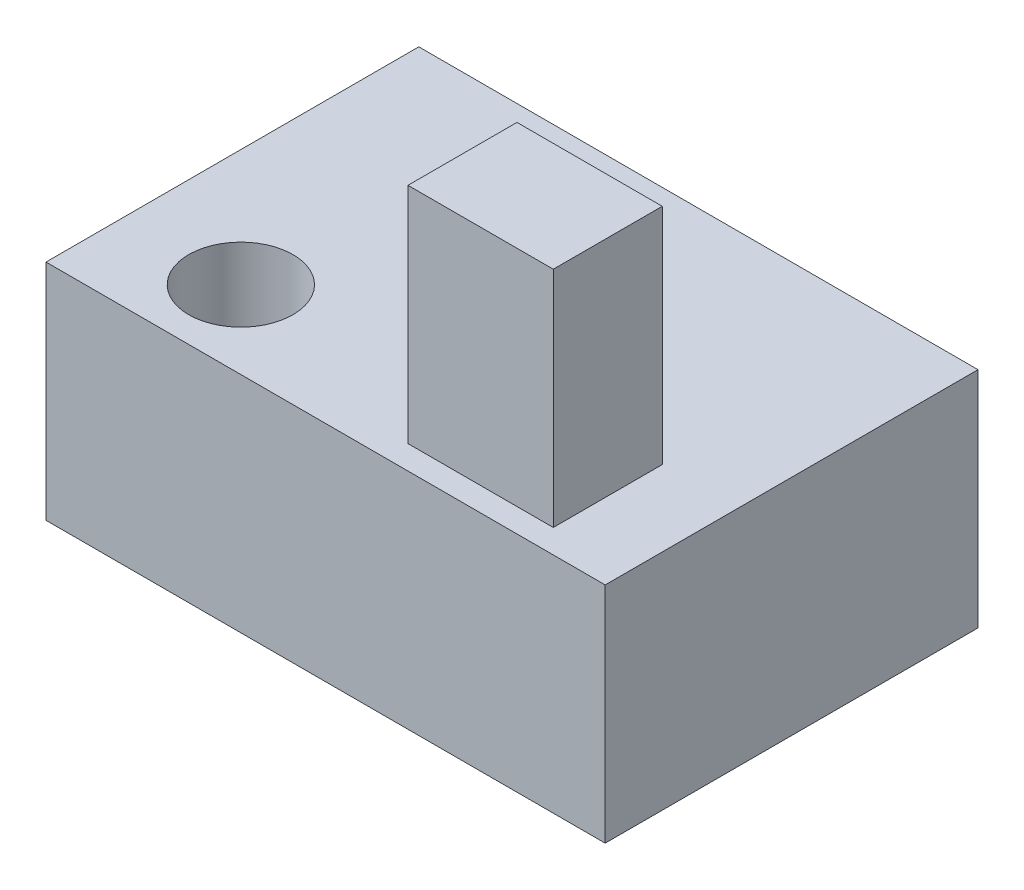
ISO-10303-21;
HEADER;
FILE_DESCRIPTION(('STEP AP214'),'2;1');
FILE_NAME('part.step','',(''),(''),'','','');
FILE_SCHEMA(('AUTOMOTIVE_DESIGN { 1 0 10303 214 1 1 1 1 }'));
ENDSEC;
DATA;
#1=APPLICATION_CONTEXT('core data for automotive mechanical design processes');
#2=APPLICATION_PROTOCOL_DEFINITION('international standard','automotive_design',2000,#1);
#3=PRODUCT_CONTEXT('',#1,'mechanical');
#4=PRODUCT('Part','Part','',(#3));
#5=PRODUCT_RELATED_PRODUCT_CATEGORY('part','',(#4));
#6=PRODUCT_DEFINITION_FORMATION('','',#4);
#7=PRODUCT_DEFINITION_CONTEXT('part definition',#1,'design');
#8=PRODUCT_DEFINITION('design','',#6,#7);
#9=PRODUCT_DEFINITION_SHAPE('','',#8);
#10=(LENGTH_UNIT() NAMED_UNIT(*) SI_UNIT(.MILLI.,.METRE.));
#11=(NAMED_UNIT(*) PLANE_ANGLE_UNIT() SI_UNIT($,.RADIAN.));
#12=(NAMED_UNIT(*) SI_UNIT($,.STERADIAN.) SOLID_ANGLE_UNIT());
#13=UNCERTAINTY_MEASURE_WITH_UNIT(LENGTH_MEASURE(1.E-05),#10,'distance_accuracy_value','');
#14=(GEOMETRIC_REPRESENTATION_CONTEXT(3) GLOBAL_UNCERTAINTY_ASSIGNED_CONTEXT((#13)) GLOBAL_UNIT_ASSIGNED_CONTEXT((#10,
#11,#12)) REPRESENTATION_CONTEXT('',''));
#15=CARTESIAN_POINT('',(0.,0.,0.));
#16=DIRECTION('',(0.,0.,1.));
#17=DIRECTION('',(1.,0.,0.));
#18=AXIS2_PLACEMENT_3D('',#15,#16,#17);
#19=CARTESIAN_POINT('',(-75.,60.,50.));
#20=DIRECTION('',(0.,1.,0.));
#21=DIRECTION('',(0.,0.,1.));
#22=AXIS2_PLACEMENT_3D('',#19,#20,#21);
#23=PLANE('',#22);
#24=CARTESIAN_POINT('',(-43.6189201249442,60.,29.1164658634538));
#25=DIRECTION('',(0.,1.,0.));
#26=DIRECTION('',(0.,0.,1.));
#27=AXIS2_PLACEMENT_3D('',#24,#25,#26);
#28=CIRCLE('',#27,13.9780946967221);
#29=CARTESIAN_POINT('',(-43.6189201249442,60.,43.0945605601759));
#30=VERTEX_POINT('',#29);
#31=EDGE_CURVE('E221',#30,#30,#28,.T.);
#32=ORIENTED_EDGE('',*,*,#31,.F.);
#33=EDGE_LOOP('',(#32));
#34=FACE_BOUND('',#33,.T.);
#35=DIRECTION('',(0.,0.,1.));
#36=VECTOR('',#35,1.);
#37=CARTESIAN_POINT('',(-75.,60.,-50.));
#38=LINE('',#37,#36);
#39=CARTESIAN_POINT('',(-75.,60.,-50.));
#40=VERTEX_POINT('',#39);
#41=CARTESIAN_POINT('',(-75.,60.,50.));
#42=VERTEX_POINT('',#41);
#43=EDGE_CURVE('E142',#40,#42,#38,.T.);
#44=ORIENTED_EDGE('',*,*,#43,.T.);
#45=DIRECTION('',(1.,0.,0.));
#46=VECTOR('',#45,1.);
#47=CARTESIAN_POINT('',(-75.,60.,50.));
#48=LINE('',#47,#46);
#49=CARTESIAN_POINT('',(75.,60.,50.));
#50=VERTEX_POINT('',#49);
#51=EDGE_CURVE('E144',#42,#50,#48,.T.);
#52=ORIENTED_EDGE('',*,*,#51,.T.);
#53=DIRECTION('',(0.,0.,-1.));
#54=VECTOR('',#53,1.);
#55=CARTESIAN_POINT('',(75.,60.,-50.));
#56=LINE('',#55,#54);
#57=CARTESIAN_POINT('',(75.,60.,-50.));
#58=VERTEX_POINT('',#57);
#59=EDGE_CURVE('E146',#50,#58,#56,.T.);
#60=ORIENTED_EDGE('',*,*,#59,.T.);
#61=DIRECTION('',(-1.,0.,0.));
#62=VECTOR('',#61,1.);
#63=CARTESIAN_POINT('',(-75.,60.,-50.));
#64=LINE('',#63,#62);
#65=EDGE_CURVE('E49',#58,#40,#64,.T.);
#66=ORIENTED_EDGE('',*,*,#65,.T.);
#67=EDGE_LOOP('',(#44,#52,#60,#66));
#68=FACE_BOUND('',#67,.T.);
#69=DIRECTION('',(-1.,0.,0.));
#70=VECTOR('',#69,1.);
#71=CARTESIAN_POINT('',(54.6973141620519,60.,14.3940300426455));
#72=LINE('',#71,#70);
#73=CARTESIAN_POINT('',(54.6973141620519,60.,14.3940300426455));
#74=VERTEX_POINT('',#73);
#75=CARTESIAN_POINT('',(15.7227097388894,60.,14.3940300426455));
#76=VERTEX_POINT('',#75);
#77=EDGE_CURVE('E97',#74,#76,#72,.T.);
#78=ORIENTED_EDGE('',*,*,#77,.F.);
#79=DIRECTION('',(0.,0.,-1.));
#80=VECTOR('',#79,1.);
#81=CARTESIAN_POINT('',(54.6973141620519,60.,43.6249833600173));
#82=LINE('',#81,#80);
#83=CARTESIAN_POINT('',(54.6973141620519,60.,43.6249833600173));
#84=VERTEX_POINT('',#83);
#85=EDGE_CURVE('E108',#84,#74,#82,.T.);
#86=ORIENTED_EDGE('',*,*,#85,.F.);
#87=DIRECTION('',(1.,0.,0.));
#88=VECTOR('',#87,1.);
#89=CARTESIAN_POINT('',(54.6973141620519,60.,43.6249833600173));
#90=LINE('',#89,#88);
#91=CARTESIAN_POINT('',(15.7227097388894,60.,43.6249833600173));
#92=VERTEX_POINT('',#91);
#93=EDGE_CURVE('E119',#92,#84,#90,.T.);
#94=ORIENTED_EDGE('',*,*,#93,.F.);
#95=DIRECTION('',(0.,0.,1.));
#96=VECTOR('',#95,1.);
#97=CARTESIAN_POINT('',(15.7227097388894,60.,43.6249833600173));
#98=LINE('',#97,#96);
#99=EDGE_CURVE('E117',#76,#92,#98,.T.);
#100=ORIENTED_EDGE('',*,*,#99,.F.);
#101=EDGE_LOOP('',(#78,#86,#94,#100));
#102=FACE_BOUND('',#101,.T.);
#103=ADVANCED_FACE('F26',(#34,#68,#102),#23,.T.);
#104=CARTESIAN_POINT('',(-75.,60.,-50.));
#105=DIRECTION('',(1.,0.,0.));
#106=DIRECTION('',(0.,0.,-1.));
#107=AXIS2_PLACEMENT_3D('',#104,#105,#106);
#108=PLANE('',#107);
#109=DIRECTION('',(0.,0.,1.));
#110=VECTOR('',#109,1.);
#111=CARTESIAN_POINT('',(-75.,0.,-50.));
#112=LINE('',#111,#110);
#113=CARTESIAN_POINT('',(-75.,0.,-50.));
#114=VERTEX_POINT('',#113);
#115=CARTESIAN_POINT('',(-75.,0.,50.));
#116=VERTEX_POINT('',#115);
#117=EDGE_CURVE('E103',#114,#116,#112,.T.);
#118=ORIENTED_EDGE('',*,*,#117,.T.);
#119=DIRECTION('',(0.,-1.,0.));
#120=VECTOR('',#119,1.);
#121=CARTESIAN_POINT('',(-75.,60.,50.));
#122=LINE('',#121,#120);
#123=EDGE_CURVE('E11',#42,#116,#122,.T.);
#124=ORIENTED_EDGE('',*,*,#123,.F.);
#125=ORIENTED_EDGE('',*,*,#43,.F.);
#126=DIRECTION('',(0.,-1.,0.));
#127=VECTOR('',#126,1.);
#128=CARTESIAN_POINT('',(-75.,60.,-50.));
#129=LINE('',#128,#127);
#130=EDGE_CURVE('E149',#40,#114,#129,.T.);
#131=ORIENTED_EDGE('',*,*,#130,.T.);
#132=EDGE_LOOP('',(#118,#124,#125,#131));
#133=FACE_BOUND('',#132,.T.);
#134=ADVANCED_FACE('F28',(#133),#108,.F.);
#135=CARTESIAN_POINT('',(-75.,60.,50.));
#136=DIRECTION('',(0.,0.,-1.));
#137=DIRECTION('',(-1.,0.,0.));
#138=AXIS2_PLACEMENT_3D('',#135,#136,#137);
#139=PLANE('',#138);
#140=DIRECTION('',(1.,0.,0.));
#141=VECTOR('',#140,1.);
#142=CARTESIAN_POINT('',(-75.,0.,50.));
#143=LINE('',#142,#141);
#144=CARTESIAN_POINT('',(75.,0.,50.));
#145=VERTEX_POINT('',#144);
#146=EDGE_CURVE('E136',#116,#145,#143,.T.);
#147=ORIENTED_EDGE('',*,*,#146,.T.);
#148=DIRECTION('',(0.,-1.,0.));
#149=VECTOR('',#148,1.);
#150=CARTESIAN_POINT('',(75.,60.,50.));
#151=LINE('',#150,#149);
#152=EDGE_CURVE('E34',#50,#145,#151,.T.);
#153=ORIENTED_EDGE('',*,*,#152,.F.);
#154=ORIENTED_EDGE('',*,*,#51,.F.);
#155=ORIENTED_EDGE('',*,*,#123,.T.);
#156=EDGE_LOOP('',(#147,#153,#154,#155));
#157=FACE_BOUND('',#156,.T.);
#158=ADVANCED_FACE('F171',(#157),#139,.F.);
#159=CARTESIAN_POINT('',(75.,60.,-50.));
#160=DIRECTION('',(-1.,0.,0.));
#161=DIRECTION('',(0.,0.,1.));
#162=AXIS2_PLACEMENT_3D('',#159,#160,#161);
#163=PLANE('',#162);
#164=DIRECTION('',(0.,0.,-1.));
#165=VECTOR('',#164,1.);
#166=CARTESIAN_POINT('',(75.,0.,-50.));
#167=LINE('',#166,#165);
#168=CARTESIAN_POINT('',(75.,0.,-50.));
#169=VERTEX_POINT('',#168);
#170=EDGE_CURVE('E138',#145,#169,#167,.T.);
#171=ORIENTED_EDGE('',*,*,#170,.T.);
#172=DIRECTION('',(0.,-1.,0.));
#173=VECTOR('',#172,1.);
#174=CARTESIAN_POINT('',(75.,60.,-50.));
#175=LINE('',#174,#173);
#176=EDGE_CURVE('E152',#58,#169,#175,.T.);
#177=ORIENTED_EDGE('',*,*,#176,.F.);
#178=ORIENTED_EDGE('',*,*,#59,.F.);
#179=ORIENTED_EDGE('',*,*,#152,.T.);
#180=EDGE_LOOP('',(#171,#177,#178,#179));
#181=FACE_BOUND('',#180,.T.);
#182=ADVANCED_FACE('F159',(#181),#163,.F.);
#183=CARTESIAN_POINT('',(-75.,60.,-50.));
#184=DIRECTION('',(0.,0.,1.));
#185=DIRECTION('',(1.,0.,0.));
#186=AXIS2_PLACEMENT_3D('',#183,#184,#185);
#187=PLANE('',#186);
#188=DIRECTION('',(-1.,0.,0.));
#189=VECTOR('',#188,1.);
#190=CARTESIAN_POINT('',(-75.,0.,-50.));
#191=LINE('',#190,#189);
#192=EDGE_CURVE('E140',#169,#114,#191,.T.);
#193=ORIENTED_EDGE('',*,*,#192,.T.);
#194=ORIENTED_EDGE('',*,*,#130,.F.);
#195=ORIENTED_EDGE('',*,*,#65,.F.);
#196=ORIENTED_EDGE('',*,*,#176,.T.);
#197=EDGE_LOOP('',(#193,#194,#195,#196));
#198=FACE_BOUND('',#197,.T.);
#199=ADVANCED_FACE('F167',(#198),#187,.F.);
#200=CARTESIAN_POINT('',(-75.,0.,50.));
#201=DIRECTION('',(0.,1.,0.));
#202=DIRECTION('',(0.,0.,1.));
#203=AXIS2_PLACEMENT_3D('',#200,#201,#202);
#204=PLANE('',#203);
#205=ORIENTED_EDGE('',*,*,#117,.F.);
#206=ORIENTED_EDGE('',*,*,#192,.F.);
#207=ORIENTED_EDGE('',*,*,#170,.F.);
#208=ORIENTED_EDGE('',*,*,#146,.F.);
#209=EDGE_LOOP('',(#205,#206,#207,#208));
#210=FACE_BOUND('',#209,.T.);
#211=ADVANCED_FACE('F165',(#210),#204,.F.);
#212=CARTESIAN_POINT('',(54.6973141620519,120.,43.6249833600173));
#213=DIRECTION('',(-1.,0.,0.));
#214=DIRECTION('',(0.,0.,1.));
#215=AXIS2_PLACEMENT_3D('',#212,#213,#214);
#216=PLANE('',#215);
#217=ORIENTED_EDGE('',*,*,#85,.T.);
#218=DIRECTION('',(0.,-1.,0.));
#219=VECTOR('',#218,1.);
#220=CARTESIAN_POINT('',(54.6973141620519,120.,14.3940300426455));
#221=LINE('',#220,#219);
#222=CARTESIAN_POINT('',(54.6973141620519,120.,14.3940300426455));
#223=VERTEX_POINT('',#222);
#224=EDGE_CURVE('E92',#223,#74,#221,.T.);
#225=ORIENTED_EDGE('',*,*,#224,.F.);
#226=DIRECTION('',(0.,0.,-1.));
#227=VECTOR('',#226,1.);
#228=CARTESIAN_POINT('',(54.6973141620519,120.,43.6249833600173));
#229=LINE('',#228,#227);
#230=CARTESIAN_POINT('',(54.6973141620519,120.,43.6249833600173));
#231=VERTEX_POINT('',#230);
#232=EDGE_CURVE('E124',#231,#223,#229,.T.);
#233=ORIENTED_EDGE('',*,*,#232,.F.);
#234=DIRECTION('',(0.,-1.,0.));
#235=VECTOR('',#234,1.);
#236=CARTESIAN_POINT('',(54.6973141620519,120.,43.6249833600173));
#237=LINE('',#236,#235);
#238=EDGE_CURVE('E111',#231,#84,#237,.T.);
#239=ORIENTED_EDGE('',*,*,#238,.T.);
#240=EDGE_LOOP('',(#217,#225,#233,#239));
#241=FACE_BOUND('',#240,.T.);
#242=ADVANCED_FACE('F109',(#241),#216,.F.);
#243=CARTESIAN_POINT('',(54.6973141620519,120.,14.3940300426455));
#244=DIRECTION('',(0.,0.,1.));
#245=DIRECTION('',(1.,0.,0.));
#246=AXIS2_PLACEMENT_3D('',#243,#244,#245);
#247=PLANE('',#246);
#248=ORIENTED_EDGE('',*,*,#77,.T.);
#249=DIRECTION('',(0.,-1.,0.));
#250=VECTOR('',#249,1.);
#251=CARTESIAN_POINT('',(15.7227097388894,120.,14.3940300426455));
#252=LINE('',#251,#250);
#253=CARTESIAN_POINT('',(15.7227097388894,120.,14.3940300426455));
#254=VERTEX_POINT('',#253);
#255=EDGE_CURVE('E104',#254,#76,#252,.T.);
#256=ORIENTED_EDGE('',*,*,#255,.F.);
#257=DIRECTION('',(-1.,0.,0.));
#258=VECTOR('',#257,1.);
#259=CARTESIAN_POINT('',(54.6973141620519,120.,14.3940300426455));
#260=LINE('',#259,#258);
#261=EDGE_CURVE('E99',#223,#254,#260,.T.);
#262=ORIENTED_EDGE('',*,*,#261,.F.);
#263=ORIENTED_EDGE('',*,*,#224,.T.);
#264=EDGE_LOOP('',(#248,#256,#262,#263));
#265=FACE_BOUND('',#264,.T.);
#266=ADVANCED_FACE('F94',(#265),#247,.F.);
#267=CARTESIAN_POINT('',(15.7227097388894,120.,43.6249833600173));
#268=DIRECTION('',(1.,0.,0.));
#269=DIRECTION('',(0.,0.,-1.));
#270=AXIS2_PLACEMENT_3D('',#267,#268,#269);
#271=PLANE('',#270);
#272=ORIENTED_EDGE('',*,*,#99,.T.);
#273=DIRECTION('',(0.,-1.,0.));
#274=VECTOR('',#273,1.);
#275=CARTESIAN_POINT('',(15.7227097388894,120.,43.6249833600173));
#276=LINE('',#275,#274);
#277=CARTESIAN_POINT('',(15.7227097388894,120.,43.6249833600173));
#278=VERTEX_POINT('',#277);
#279=EDGE_CURVE('E41',#278,#92,#276,.T.);
#280=ORIENTED_EDGE('',*,*,#279,.F.);
#281=DIRECTION('',(0.,0.,1.));
#282=VECTOR('',#281,1.);
#283=CARTESIAN_POINT('',(15.7227097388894,120.,43.6249833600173));
#284=LINE('',#283,#282);
#285=EDGE_CURVE('E127',#254,#278,#284,.T.);
#286=ORIENTED_EDGE('',*,*,#285,.F.);
#287=ORIENTED_EDGE('',*,*,#255,.T.);
#288=EDGE_LOOP('',(#272,#280,#286,#287));
#289=FACE_BOUND('',#288,.T.);
#290=ADVANCED_FACE('F199',(#289),#271,.F.);
#291=CARTESIAN_POINT('',(54.6973141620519,120.,43.6249833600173));
#292=DIRECTION('',(0.,0.,-1.));
#293=DIRECTION('',(-1.,0.,0.));
#294=AXIS2_PLACEMENT_3D('',#291,#292,#293);
#295=PLANE('',#294);
#296=ORIENTED_EDGE('',*,*,#93,.T.);
#297=ORIENTED_EDGE('',*,*,#238,.F.);
#298=DIRECTION('',(1.,0.,0.));
#299=VECTOR('',#298,1.);
#300=CARTESIAN_POINT('',(54.6973141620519,120.,43.6249833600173));
#301=LINE('',#300,#299);
#302=EDGE_CURVE('E129',#278,#231,#301,.T.);
#303=ORIENTED_EDGE('',*,*,#302,.F.);
#304=ORIENTED_EDGE('',*,*,#279,.T.);
#305=EDGE_LOOP('',(#296,#297,#303,#304));
#306=FACE_BOUND('',#305,.T.);
#307=ADVANCED_FACE('F204',(#306),#295,.F.);
#308=CARTESIAN_POINT('',(54.6973141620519,120.,14.3940300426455));
#309=DIRECTION('',(0.,1.,0.));
#310=DIRECTION('',(0.,0.,1.));
#311=AXIS2_PLACEMENT_3D('',#308,#309,#310);
#312=PLANE('',#311);
#313=ORIENTED_EDGE('',*,*,#232,.T.);
#314=ORIENTED_EDGE('',*,*,#261,.T.);
#315=ORIENTED_EDGE('',*,*,#285,.T.);
#316=ORIENTED_EDGE('',*,*,#302,.T.);
#317=EDGE_LOOP('',(#313,#314,#315,#316));
#318=FACE_BOUND('',#317,.T.);
#319=ADVANCED_FACE('F208',(#318),#312,.T.);
#320=CARTESIAN_POINT('',(-43.6189201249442,40.,29.1164658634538));
#321=DIRECTION('',(0.,1.,0.));
#322=DIRECTION('',(0.,0.,1.));
#323=AXIS2_PLACEMENT_3D('',#320,#321,#322);
#324=CYLINDRICAL_SURFACE('',#323,13.9780946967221);
#325=CARTESIAN_POINT('',(-43.6189201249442,40.,29.1164658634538));
#326=DIRECTION('',(0.,1.,0.));
#327=DIRECTION('',(0.,0.,1.));
#328=AXIS2_PLACEMENT_3D('',#325,#326,#327);
#329=CIRCLE('',#328,13.9780946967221);
#330=CARTESIAN_POINT('',(-43.6189201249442,40.,43.0945605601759));
#331=VERTEX_POINT('',#330);
#332=EDGE_CURVE('E114',#331,#331,#329,.T.);
#333=ORIENTED_EDGE('',*,*,#332,.F.);
#334=EDGE_LOOP('',(#333));
#335=FACE_BOUND('',#334,.T.);
#336=ORIENTED_EDGE('',*,*,#31,.T.);
#337=EDGE_LOOP('',(#336));
#338=FACE_BOUND('',#337,.T.);
#339=ADVANCED_FACE('F210',(#335,#338),#324,.F.);
#340=CARTESIAN_POINT('',(-43.6189201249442,40.,29.1164658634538));
#341=DIRECTION('',(0.,1.,0.));
#342=DIRECTION('',(0.,0.,1.));
#343=AXIS2_PLACEMENT_3D('',#340,#341,#342);
#344=PLANE('',#343);
#345=ORIENTED_EDGE('',*,*,#332,.T.);
#346=EDGE_LOOP('',(#345));
#347=FACE_BOUND('',#346,.T.);
#348=ADVANCED_FACE('F213',(#347),#344,.T.);
#349=CLOSED_SHELL('',(#103,#134,#158,#182,#199,#211,#242,#266,#290,#307,#319,#339,#348));
#350=MANIFOLD_SOLID_BREP('B2',#349);
#351=ADVANCED_BREP_SHAPE_REPRESENTATION('',(#18,#350),#14);
#352=SHAPE_DEFINITION_REPRESENTATION(#9,#351);
ENDSEC;
END-ISO-10303-21;
